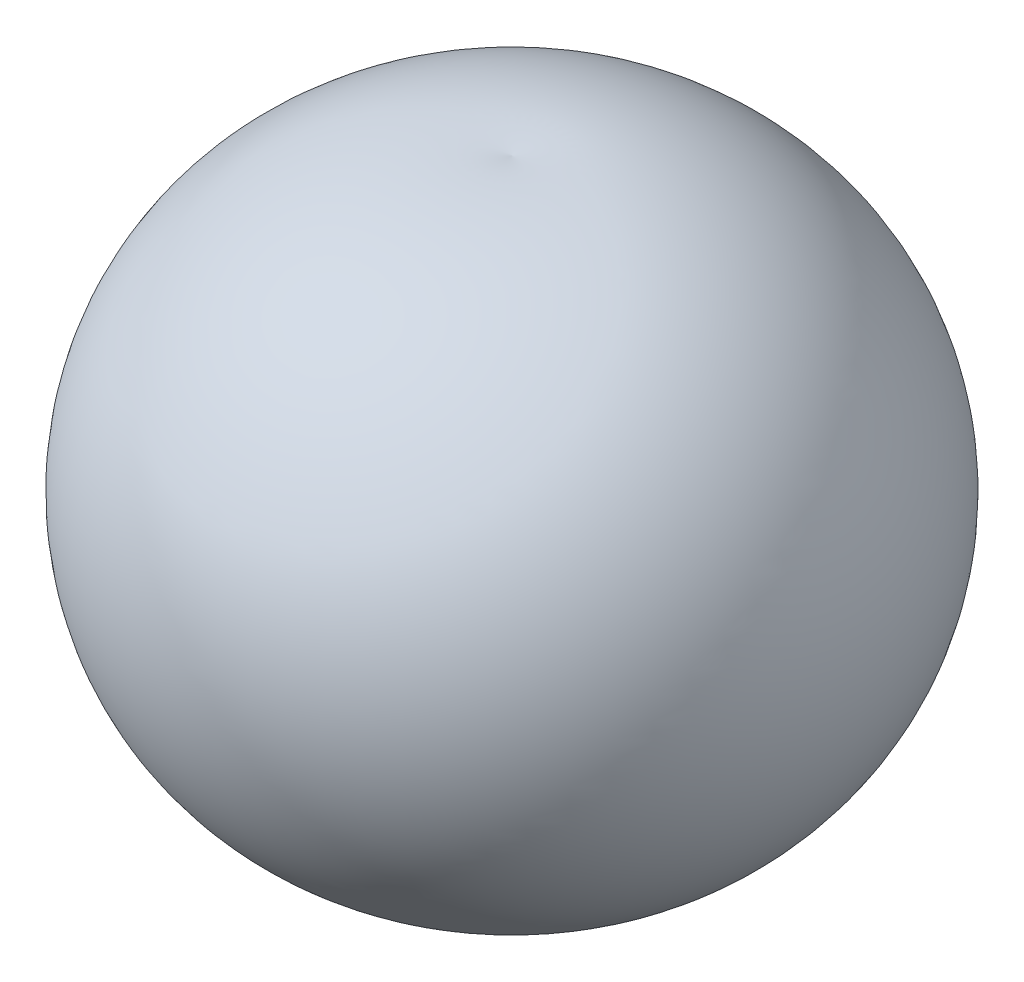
ISO-10303-21;
HEADER;
FILE_DESCRIPTION(('STEP AP214'),'2;1');
FILE_NAME('part.step','',(''),(''),'','','');
FILE_SCHEMA(('AUTOMOTIVE_DESIGN { 1 0 10303 214 1 1 1 1 }'));
ENDSEC;
DATA;
#1=APPLICATION_CONTEXT('core data for automotive mechanical design processes');
#2=APPLICATION_PROTOCOL_DEFINITION('international standard','automotive_design',2000,#1);
#3=PRODUCT_CONTEXT('',#1,'mechanical');
#4=PRODUCT('Part','Part','',(#3));
#5=PRODUCT_RELATED_PRODUCT_CATEGORY('part','',(#4));
#6=PRODUCT_DEFINITION_FORMATION('','',#4);
#7=PRODUCT_DEFINITION_CONTEXT('part definition',#1,'design');
#8=PRODUCT_DEFINITION('design','',#6,#7);
#9=PRODUCT_DEFINITION_SHAPE('','',#8);
#10=(LENGTH_UNIT() NAMED_UNIT(*) SI_UNIT(.MILLI.,.METRE.));
#11=(NAMED_UNIT(*) PLANE_ANGLE_UNIT() SI_UNIT($,.RADIAN.));
#12=(NAMED_UNIT(*) SI_UNIT($,.STERADIAN.) SOLID_ANGLE_UNIT());
#13=UNCERTAINTY_MEASURE_WITH_UNIT(LENGTH_MEASURE(1.E-05),#10,'distance_accuracy_value','');
#14=(GEOMETRIC_REPRESENTATION_CONTEXT(3) GLOBAL_UNCERTAINTY_ASSIGNED_CONTEXT((#13)) GLOBAL_UNIT_ASSIGNED_CONTEXT((#10,
#11,#12)) REPRESENTATION_CONTEXT('',''));
#15=CARTESIAN_POINT('',(0.,0.,0.));
#16=DIRECTION('',(0.,0.,1.));
#17=DIRECTION('',(1.,0.,0.));
#18=AXIS2_PLACEMENT_3D('',#15,#16,#17);
#19=CARTESIAN_POINT('',(0.,-47.4707580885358,743.275735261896));
#20=DIRECTION('',(-1.,0.,0.));
#21=DIRECTION('',(0.,0.,1.));
#22=AXIS2_PLACEMENT_3D('',#19,#20,#21);
#23=CIRCLE('',#22,1127.87410644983);
#24=TRIMMED_CURVE('',#23,(PARAMETER_VALUE(-2.29029267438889)),
(PARAMETER_VALUE(2.29029267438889)),.T.,.PARAMETER.);
#25=CARTESIAN_POINT('',(0.,-47.4707580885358,0.));
#26=DIRECTION('',(0.,1.,0.));
#27=AXIS1_PLACEMENT('',#25,#26);
#28=SURFACE_OF_REVOLUTION('',#24,#27);
#29=CARTESIAN_POINT('',(0.,-895.787433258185,0.));
#30=VERTEX_POINT('',#29);
#31=VERTEX_LOOP('',#30);
#32=FACE_BOUND('',#31,.T.);
#33=CARTESIAN_POINT('',(0.,-971.371138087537,0.));
#34=DIRECTION('',(0.,1.,0.));
#35=DIRECTION('',(0.,0.,1.));
#36=AXIS2_PLACEMENT_3D('',#33,#34,#35);
#37=CIRCLE('',#36,1390.197745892);
#38=CARTESIAN_POINT('',(0.,-971.371138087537,1390.197745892));
#39=VERTEX_POINT('',#38);
#40=EDGE_CURVE('E62',#39,#39,#37,.T.);
#41=ORIENTED_EDGE('',*,*,#40,.F.);
#42=EDGE_LOOP('',(#41));
#43=FACE_BOUND('',#42,.T.);
#44=ADVANCED_FACE('F36',(#32,#43),#28,.T.);
#45=CARTESIAN_POINT('',(0.,657.,250.));
#46=DIRECTION('',(-1.,0.,0.));
#47=DIRECTION('',(0.,0.,1.));
#48=AXIS2_PLACEMENT_3D('',#45,#46,#47);
#49=CIRCLE('',#48,1987.87410644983);
#50=TRIMMED_CURVE('',#49,(PARAMETER_VALUE(-1.69689271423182)),
(PARAMETER_VALUE(1.69689271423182)),.T.,.PARAMETER.);
#51=CARTESIAN_POINT('',(0.,657.,0.));
#52=DIRECTION('',(0.,1.,0.));
#53=AXIS1_PLACEMENT('',#51,#52);
#54=SURFACE_OF_REVOLUTION('',#50,#53);
#55=ORIENTED_EDGE('',*,*,#40,.T.);
#56=EDGE_LOOP('',(#55));
#57=FACE_BOUND('',#56,.T.);
#58=CARTESIAN_POINT('',(0.,2629.09113965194,0.));
#59=VERTEX_POINT('',#58);
#60=VERTEX_LOOP('',#59);
#61=FACE_BOUND('',#60,.T.);
#62=ADVANCED_FACE('F59',(#57,#61),#54,.T.);
#63=CLOSED_SHELL('',(#44,#62));
#64=CARTESIAN_POINT('',(0.,657.,250.));
#65=DIRECTION('',(-1.,0.,0.));
#66=DIRECTION('',(0.,0.,1.));
#67=AXIS2_PLACEMENT_3D('',#64,#65,#66);
#68=CIRCLE('',#67,318.164481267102);
#69=TRIMMED_CURVE('',#68,(PARAMETER_VALUE(-2.47471552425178)),
(PARAMETER_VALUE(2.47471552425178)),.T.,.PARAMETER.);
#70=CARTESIAN_POINT('',(0.,657.,0.));
#71=DIRECTION('',(0.,1.,0.));
#72=AXIS1_PLACEMENT('',#70,#71);
#73=SURFACE_OF_REVOLUTION('',#69,#72);
#74=CARTESIAN_POINT('',(0.,563.943329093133,0.));
#75=DIRECTION('',(0.,1.,0.));
#76=DIRECTION('',(0.,0.,1.));
#77=AXIS2_PLACEMENT_3D('',#74,#75,#76);
#78=CIRCLE('',#77,554.251693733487);
#79=CARTESIAN_POINT('',(0.,563.943329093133,554.251693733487));
#80=VERTEX_POINT('',#79);
#81=EDGE_CURVE('E11',#80,#80,#78,.T.);
#82=ORIENTED_EDGE('',*,*,#81,.T.);
#83=EDGE_LOOP('',(#82));
#84=FACE_BOUND('',#83,.T.);
#85=CARTESIAN_POINT('',(0.,460.204072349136,0.));
#86=VERTEX_POINT('',#85);
#87=VERTEX_LOOP('',#86);
#88=FACE_BOUND('',#87,.T.);
#89=ADVANCED_FACE('F78',(#84,#88),#73,.F.);
#90=CARTESIAN_POINT('',(0.,1361.47075808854,0.));
#91=DIRECTION('',(0.,1.,0.));
#92=DIRECTION('',(0.,0.,1.));
#93=AXIS2_PLACEMENT_3D('',#90,#91,#92);
#94=DEGENERATE_TOROIDAL_SURFACE('',#93,243.275735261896,1127.87410644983,.F.);
#95=CARTESIAN_POINT('',(0.,1459.77146356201,0.));
#96=DIRECTION('',(0.,1.,0.));
#97=DIRECTION('',(0.,0.,1.));
#98=AXIS2_PLACEMENT_3D('',#95,#96,#97);
#99=CIRCLE('',#98,880.30646969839);
#100=CARTESIAN_POINT('',(0.,1459.77146356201,880.30646969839));
#101=VERTEX_POINT('',#100);
#102=EDGE_CURVE('E44',#101,#101,#99,.T.);
#103=ORIENTED_EDGE('',*,*,#102,.T.);
#104=EDGE_LOOP('',(#103));
#105=FACE_BOUND('',#104,.T.);
#106=ORIENTED_EDGE('',*,*,#81,.F.);
#107=EDGE_LOOP('',(#106));
#108=FACE_BOUND('',#107,.T.);
#109=ADVANCED_FACE('F68',(#105,#108),#94,.T.);
#110=CARTESIAN_POINT('',(0.,657.,250.));
#111=DIRECTION('',(-1.,0.,0.));
#112=DIRECTION('',(0.,0.,1.));
#113=AXIS2_PLACEMENT_3D('',#110,#111,#112);
#114=CIRCLE('',#113,1020.65090430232);
#115=TRIMMED_CURVE('',#114,(PARAMETER_VALUE(-1.81825591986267)),
(PARAMETER_VALUE(1.81825591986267)),.T.,.PARAMETER.);
#116=CARTESIAN_POINT('',(0.,657.,0.));
#117=DIRECTION('',(0.,1.,0.));
#118=AXIS1_PLACEMENT('',#116,#117);
#119=SURFACE_OF_REVOLUTION('',#115,#118);
#120=CARTESIAN_POINT('',(0.,1646.5596336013,0.));
#121=VERTEX_POINT('',#120);
#122=VERTEX_LOOP('',#121);
#123=FACE_BOUND('',#122,.T.);
#124=ORIENTED_EDGE('',*,*,#102,.F.);
#125=EDGE_LOOP('',(#124));
#126=FACE_BOUND('',#125,.T.);
#127=ADVANCED_FACE('F71',(#123,#126),#119,.F.);
#128=CLOSED_SHELL('',(#89,#109,#127));
#129=ORIENTED_CLOSED_SHELL('',*,#128,.T.);
#130=BREP_WITH_VOIDS('B2',#63,(#129));
#131=ADVANCED_BREP_SHAPE_REPRESENTATION('',(#18,#130),#14);
#132=SHAPE_DEFINITION_REPRESENTATION(#9,#131);
ENDSEC;
END-ISO-10303-21;
